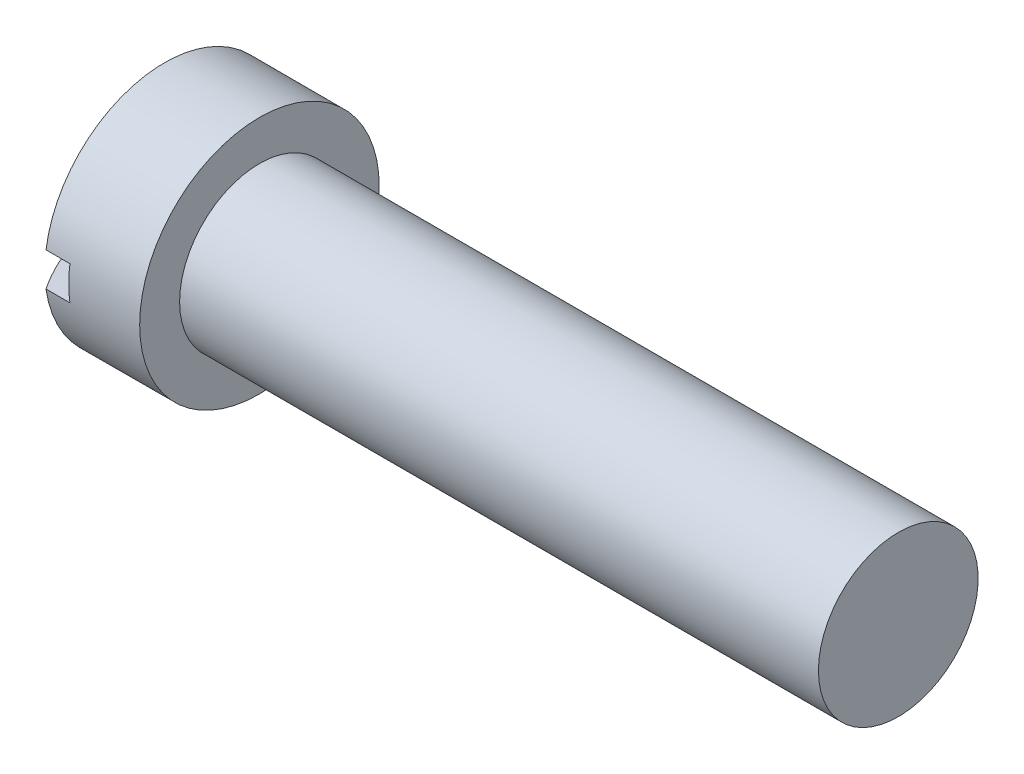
ISO-10303-21;
HEADER;
FILE_DESCRIPTION(('STEP AP214'),'2;1');
FILE_NAME('part.step','',(''),(''),'','','');
FILE_SCHEMA(('AUTOMOTIVE_DESIGN { 1 0 10303 214 1 1 1 1 }'));
ENDSEC;
DATA;
#1=APPLICATION_CONTEXT('core data for automotive mechanical design processes');
#2=APPLICATION_PROTOCOL_DEFINITION('international standard','automotive_design',2000,#1);
#3=PRODUCT_CONTEXT('',#1,'mechanical');
#4=PRODUCT('Part','Part','',(#3));
#5=PRODUCT_RELATED_PRODUCT_CATEGORY('part','',(#4));
#6=PRODUCT_DEFINITION_FORMATION('','',#4);
#7=PRODUCT_DEFINITION_CONTEXT('part definition',#1,'design');
#8=PRODUCT_DEFINITION('design','',#6,#7);
#9=PRODUCT_DEFINITION_SHAPE('','',#8);
#10=(LENGTH_UNIT() NAMED_UNIT(*) SI_UNIT(.MILLI.,.METRE.));
#11=(NAMED_UNIT(*) PLANE_ANGLE_UNIT() SI_UNIT($,.RADIAN.));
#12=(NAMED_UNIT(*) SI_UNIT($,.STERADIAN.) SOLID_ANGLE_UNIT());
#13=UNCERTAINTY_MEASURE_WITH_UNIT(LENGTH_MEASURE(1.E-05),#10,'distance_accuracy_value','');
#14=(GEOMETRIC_REPRESENTATION_CONTEXT(3) GLOBAL_UNCERTAINTY_ASSIGNED_CONTEXT((#13)) GLOBAL_UNIT_ASSIGNED_CONTEXT((#10,
#11,#12)) REPRESENTATION_CONTEXT('',''));
#15=CARTESIAN_POINT('',(0.,0.,0.));
#16=DIRECTION('',(0.,0.,1.));
#17=DIRECTION('',(1.,0.,0.));
#18=AXIS2_PLACEMENT_3D('',#15,#16,#17);
#19=CARTESIAN_POINT('',(16.9903913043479,0.,0.));
#20=DIRECTION('',(-1.,0.,0.));
#21=DIRECTION('',(0.,1.,0.));
#22=AXIS2_PLACEMENT_3D('',#19,#20,#21);
#23=SPHERICAL_SURFACE('',#22,16.9903913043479);
#24=CARTESIAN_POINT('',(2.921,0.,0.));
#25=DIRECTION('',(-1.,0.,0.));
#26=DIRECTION('',(0.,0.,1.));
#27=AXIS2_PLACEMENT_3D('',#24,#25,#26);
#28=CIRCLE('',#27,9.525);
#29=CARTESIAN_POINT('',(2.921,-1.3462,-9.42938866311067));
#30=VERTEX_POINT('',#29);
#31=CARTESIAN_POINT('',(2.921,-1.3462,9.42938866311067));
#32=VERTEX_POINT('',#31);
#33=EDGE_CURVE('E93',#30,#32,#28,.T.);
#34=ORIENTED_EDGE('',*,*,#33,.T.);
#35=CARTESIAN_POINT('',(16.9903913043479,-1.3462,0.));
#36=DIRECTION('',(0.,1.,0.));
#37=DIRECTION('',(0.,0.,1.));
#38=AXIS2_PLACEMENT_3D('',#35,#36,#37);
#39=CIRCLE('',#38,16.9369755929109);
#40=EDGE_CURVE('E117',#32,#30,#39,.F.);
#41=ORIENTED_EDGE('',*,*,#40,.T.);
#42=EDGE_LOOP('',(#34,#41));
#43=FACE_BOUND('',#42,.T.);
#44=ADVANCED_FACE('F39',(#43),#23,.T.);
#45=CARTESIAN_POINT('',(2.921,1.3462,9.42938866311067));
#46=VERTEX_POINT('',#45);
#47=CARTESIAN_POINT('',(2.921,1.3462,-9.42938866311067));
#48=VERTEX_POINT('',#47);
#49=EDGE_CURVE('E95',#46,#48,#28,.T.);
#50=ORIENTED_EDGE('',*,*,#49,.T.);
#51=CARTESIAN_POINT('',(16.9903913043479,1.3462,0.));
#52=DIRECTION('',(0.,-1.,0.));
#53=DIRECTION('',(0.,0.,-1.));
#54=AXIS2_PLACEMENT_3D('',#51,#52,#53);
#55=CIRCLE('',#54,16.9369755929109);
#56=EDGE_CURVE('E113',#48,#46,#55,.F.);
#57=ORIENTED_EDGE('',*,*,#56,.T.);
#58=EDGE_LOOP('',(#50,#57));
#59=FACE_BOUND('',#58,.T.);
#60=ADVANCED_FACE('F116',(#59),#23,.T.);
#61=CARTESIAN_POINT('',(-25.4,0.,0.));
#62=DIRECTION('',(-1.,0.,0.));
#63=DIRECTION('',(0.,0.,1.));
#64=AXIS2_PLACEMENT_3D('',#61,#62,#63);
#65=CYLINDRICAL_SURFACE('',#64,9.525);
#66=CARTESIAN_POINT('',(10.4648,0.,0.));
#67=DIRECTION('',(-1.,0.,0.));
#68=DIRECTION('',(0.,0.,1.));
#69=AXIS2_PLACEMENT_3D('',#66,#67,#68);
#70=CIRCLE('',#69,9.525);
#71=CARTESIAN_POINT('',(10.4648,0.,9.525));
#72=VERTEX_POINT('',#71);
#73=EDGE_CURVE('E96',#72,#72,#70,.T.);
#74=ORIENTED_EDGE('',*,*,#73,.T.);
#75=EDGE_LOOP('',(#74));
#76=FACE_BOUND('',#75,.T.);
#77=DIRECTION('',(-1.,0.,0.));
#78=VECTOR('',#77,1.);
#79=CARTESIAN_POINT('',(-25.4,-1.3462,-9.42938866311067));
#80=LINE('',#79,#78);
#81=CARTESIAN_POINT('',(4.826,-1.3462,-9.42938866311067));
#82=VERTEX_POINT('',#81);
#83=EDGE_CURVE('E11',#82,#30,#80,.T.);
#84=ORIENTED_EDGE('',*,*,#83,.F.);
#85=CARTESIAN_POINT('',(4.826,0.,0.));
#86=DIRECTION('',(-1.,0.,0.));
#87=DIRECTION('',(0.,0.,1.));
#88=AXIS2_PLACEMENT_3D('',#85,#86,#87);
#89=CIRCLE('',#88,9.525);
#90=CARTESIAN_POINT('',(4.826,1.3462,-9.42938866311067));
#91=VERTEX_POINT('',#90);
#92=EDGE_CURVE('E76',#91,#82,#89,.T.);
#93=ORIENTED_EDGE('',*,*,#92,.F.);
#94=DIRECTION('',(-1.,0.,0.));
#95=VECTOR('',#94,1.);
#96=CARTESIAN_POINT('',(-25.4,1.3462,-9.42938866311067));
#97=LINE('',#96,#95);
#98=EDGE_CURVE('E47',#48,#91,#97,.F.);
#99=ORIENTED_EDGE('',*,*,#98,.F.);
#100=ORIENTED_EDGE('',*,*,#49,.F.);
#101=DIRECTION('',(-1.,0.,0.));
#102=VECTOR('',#101,1.);
#103=CARTESIAN_POINT('',(-25.4,1.3462,9.42938866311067));
#104=LINE('',#103,#102);
#105=CARTESIAN_POINT('',(4.826,1.3462,9.42938866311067));
#106=VERTEX_POINT('',#105);
#107=EDGE_CURVE('E107',#106,#46,#104,.T.);
#108=ORIENTED_EDGE('',*,*,#107,.F.);
#109=CARTESIAN_POINT('',(4.826,-1.3462,9.42938866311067));
#110=VERTEX_POINT('',#109);
#111=EDGE_CURVE('E85',#110,#106,#89,.T.);
#112=ORIENTED_EDGE('',*,*,#111,.F.);
#113=DIRECTION('',(-1.,0.,0.));
#114=VECTOR('',#113,1.);
#115=CARTESIAN_POINT('',(-25.4,-1.3462,9.42938866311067));
#116=LINE('',#115,#114);
#117=EDGE_CURVE('E83',#32,#110,#116,.F.);
#118=ORIENTED_EDGE('',*,*,#117,.F.);
#119=ORIENTED_EDGE('',*,*,#33,.F.);
#120=EDGE_LOOP('',(#84,#93,#99,#100,#108,#112,#118,#119));
#121=FACE_BOUND('',#120,.T.);
#122=ADVANCED_FACE('F91',(#76,#121),#65,.T.);
#123=CARTESIAN_POINT('',(-25.4,0.,0.));
#124=DIRECTION('',(-1.,0.,0.));
#125=DIRECTION('',(0.,0.,1.));
#126=AXIS2_PLACEMENT_3D('',#123,#124,#125);
#127=CYLINDRICAL_SURFACE('',#126,6.35);
#128=CARTESIAN_POINT('',(61.2648,0.,0.));
#129=DIRECTION('',(-1.,0.,0.));
#130=DIRECTION('',(0.,0.,1.));
#131=AXIS2_PLACEMENT_3D('',#128,#129,#130);
#132=CIRCLE('',#131,6.35);
#133=CARTESIAN_POINT('',(61.2648,0.,6.35));
#134=VERTEX_POINT('',#133);
#135=EDGE_CURVE('E99',#134,#134,#132,.T.);
#136=ORIENTED_EDGE('',*,*,#135,.T.);
#137=EDGE_LOOP('',(#136));
#138=FACE_BOUND('',#137,.T.);
#139=CARTESIAN_POINT('',(10.4648,0.,0.));
#140=DIRECTION('',(-1.,0.,0.));
#141=DIRECTION('',(0.,0.,1.));
#142=AXIS2_PLACEMENT_3D('',#139,#140,#141);
#143=CIRCLE('',#142,6.35);
#144=CARTESIAN_POINT('',(10.4648,0.,6.35));
#145=VERTEX_POINT('',#144);
#146=EDGE_CURVE('E101',#145,#145,#143,.T.);
#147=ORIENTED_EDGE('',*,*,#146,.F.);
#148=EDGE_LOOP('',(#147));
#149=FACE_BOUND('',#148,.T.);
#150=ADVANCED_FACE('F41',(#138,#149),#127,.T.);
#151=CARTESIAN_POINT('',(61.2648,6.35,0.));
#152=DIRECTION('',(1.,0.,0.));
#153=DIRECTION('',(0.,0.,-1.));
#154=AXIS2_PLACEMENT_3D('',#151,#152,#153);
#155=PLANE('',#154);
#156=ORIENTED_EDGE('',*,*,#135,.F.);
#157=EDGE_LOOP('',(#156));
#158=FACE_BOUND('',#157,.T.);
#159=ADVANCED_FACE('F127',(#158),#155,.T.);
#160=CARTESIAN_POINT('',(10.4648,6.35,0.));
#161=DIRECTION('',(-1.,0.,0.));
#162=DIRECTION('',(0.,0.,1.));
#163=AXIS2_PLACEMENT_3D('',#160,#161,#162);
#164=PLANE('',#163);
#165=ORIENTED_EDGE('',*,*,#73,.F.);
#166=EDGE_LOOP('',(#165));
#167=FACE_BOUND('',#166,.T.);
#168=ORIENTED_EDGE('',*,*,#146,.T.);
#169=EDGE_LOOP('',(#168));
#170=FACE_BOUND('',#169,.T.);
#171=ADVANCED_FACE('F124',(#167,#170),#164,.F.);
#172=CARTESIAN_POINT('',(4.826,-1.3462,-9.525));
#173=DIRECTION('',(0.,1.,0.));
#174=DIRECTION('',(0.,0.,1.));
#175=AXIS2_PLACEMENT_3D('',#172,#173,#174);
#176=PLANE('',#175);
#177=ORIENTED_EDGE('',*,*,#83,.T.);
#178=ORIENTED_EDGE('',*,*,#40,.F.);
#179=ORIENTED_EDGE('',*,*,#117,.T.);
#180=DIRECTION('',(0.,0.,-1.));
#181=VECTOR('',#180,1.);
#182=CARTESIAN_POINT('',(4.826,-1.3462,-9.525));
#183=LINE('',#182,#181);
#184=EDGE_CURVE('E54',#110,#82,#183,.T.);
#185=ORIENTED_EDGE('',*,*,#184,.T.);
#186=EDGE_LOOP('',(#177,#178,#179,#185));
#187=FACE_BOUND('',#186,.T.);
#188=ADVANCED_FACE('F86',(#187),#176,.T.);
#189=CARTESIAN_POINT('',(4.826,1.3462,9.525));
#190=DIRECTION('',(0.,-1.,0.));
#191=DIRECTION('',(0.,0.,-1.));
#192=AXIS2_PLACEMENT_3D('',#189,#190,#191);
#193=PLANE('',#192);
#194=ORIENTED_EDGE('',*,*,#107,.T.);
#195=ORIENTED_EDGE('',*,*,#56,.F.);
#196=ORIENTED_EDGE('',*,*,#98,.T.);
#197=DIRECTION('',(0.,0.,1.));
#198=VECTOR('',#197,1.);
#199=CARTESIAN_POINT('',(4.826,1.3462,9.525));
#200=LINE('',#199,#198);
#201=EDGE_CURVE('E79',#91,#106,#200,.T.);
#202=ORIENTED_EDGE('',*,*,#201,.T.);
#203=EDGE_LOOP('',(#194,#195,#196,#202));
#204=FACE_BOUND('',#203,.T.);
#205=ADVANCED_FACE('F110',(#204),#193,.T.);
#206=CARTESIAN_POINT('',(4.826,-1.3462,9.525));
#207=DIRECTION('',(-1.,0.,0.));
#208=DIRECTION('',(0.,0.,1.));
#209=AXIS2_PLACEMENT_3D('',#206,#207,#208);
#210=PLANE('',#209);
#211=ORIENTED_EDGE('',*,*,#201,.F.);
#212=ORIENTED_EDGE('',*,*,#92,.T.);
#213=ORIENTED_EDGE('',*,*,#184,.F.);
#214=ORIENTED_EDGE('',*,*,#111,.T.);
#215=EDGE_LOOP('',(#211,#212,#213,#214));
#216=FACE_BOUND('',#215,.T.);
#217=ADVANCED_FACE('F77',(#216),#210,.T.);
#218=CLOSED_SHELL('',(#44,#60,#122,#150,#159,#171,#188,#205,#217));
#219=MANIFOLD_SOLID_BREP('B2',#218);
#220=ADVANCED_BREP_SHAPE_REPRESENTATION('',(#18,#219),#14);
#221=SHAPE_DEFINITION_REPRESENTATION(#9,#220);
ENDSEC;
END-ISO-10303-21;
